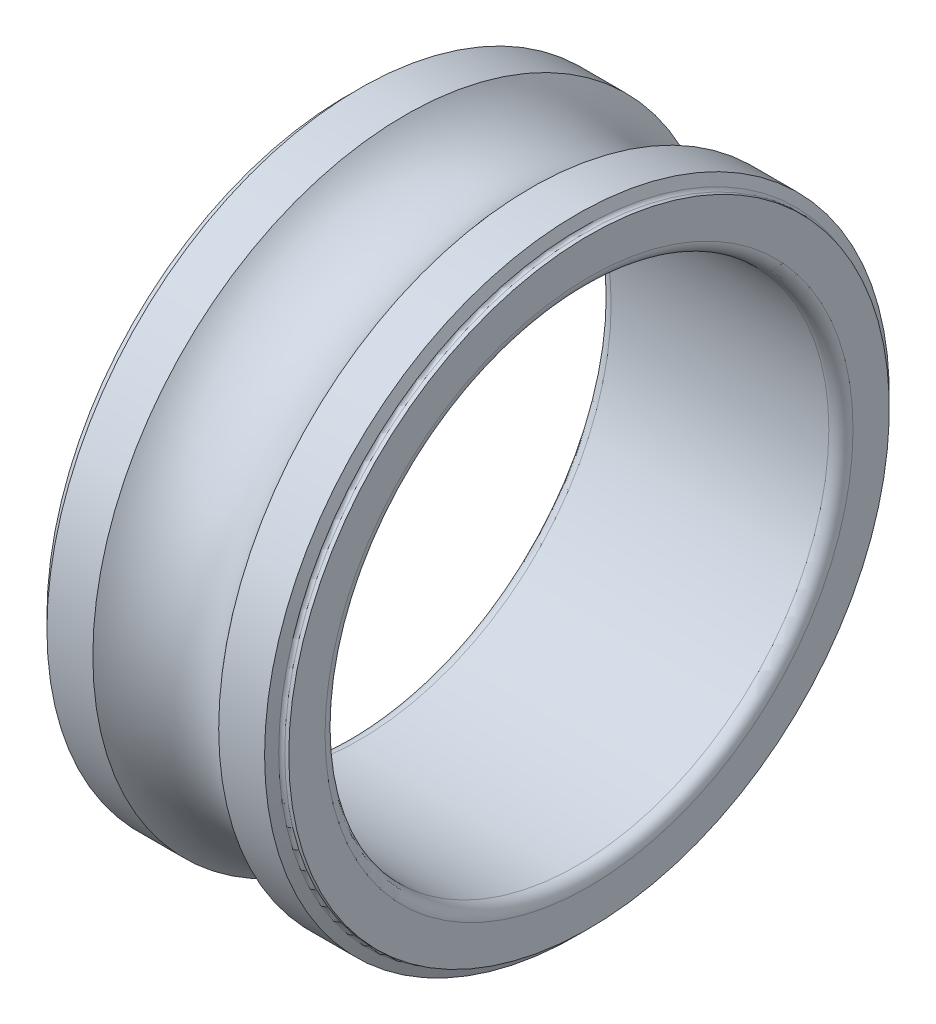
ISO-10303-21;
HEADER;
FILE_DESCRIPTION(('STEP AP214'),'2;1');
FILE_NAME('part.step','',(''),(''),'','','');
FILE_SCHEMA(('AUTOMOTIVE_DESIGN { 1 0 10303 214 1 1 1 1 }'));
ENDSEC;
DATA;
#1=APPLICATION_CONTEXT('core data for automotive mechanical design processes');
#2=APPLICATION_PROTOCOL_DEFINITION('international standard','automotive_design',2000,#1);
#3=PRODUCT_CONTEXT('',#1,'mechanical');
#4=PRODUCT('Part','Part','',(#3));
#5=PRODUCT_RELATED_PRODUCT_CATEGORY('part','',(#4));
#6=PRODUCT_DEFINITION_FORMATION('','',#4);
#7=PRODUCT_DEFINITION_CONTEXT('part definition',#1,'design');
#8=PRODUCT_DEFINITION('design','',#6,#7);
#9=PRODUCT_DEFINITION_SHAPE('','',#8);
#10=(LENGTH_UNIT() NAMED_UNIT(*) SI_UNIT(.MILLI.,.METRE.));
#11=(NAMED_UNIT(*) PLANE_ANGLE_UNIT() SI_UNIT($,.RADIAN.));
#12=(NAMED_UNIT(*) SI_UNIT($,.STERADIAN.) SOLID_ANGLE_UNIT());
#13=UNCERTAINTY_MEASURE_WITH_UNIT(LENGTH_MEASURE(1.E-05),#10,'distance_accuracy_value','');
#14=(GEOMETRIC_REPRESENTATION_CONTEXT(3) GLOBAL_UNCERTAINTY_ASSIGNED_CONTEXT((#13)) GLOBAL_UNIT_ASSIGNED_CONTEXT((#10,
#11,#12)) REPRESENTATION_CONTEXT('',''));
#15=CARTESIAN_POINT('',(0.,0.,0.));
#16=DIRECTION('',(0.,0.,1.));
#17=DIRECTION('',(1.,0.,0.));
#18=AXIS2_PLACEMENT_3D('',#15,#16,#17);
#19=CARTESIAN_POINT('',(11.8,0.,0.));
#20=DIRECTION('',(-1.,0.,0.));
#21=DIRECTION('',(0.,0.,1.));
#22=AXIS2_PLACEMENT_3D('',#19,#20,#21);
#23=TOROIDAL_SURFACE('',#22,15.1,0.200000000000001);
#24=CARTESIAN_POINT('',(11.6177124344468,0.,0.));
#25=DIRECTION('',(-1.,0.,0.));
#26=DIRECTION('',(0.,0.,1.));
#27=AXIS2_PLACEMENT_3D('',#24,#25,#26);
#28=CIRCLE('',#27,15.0177124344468);
#29=CARTESIAN_POINT('',(11.6177124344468,0.,15.0177124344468));
#30=VERTEX_POINT('',#29);
#31=EDGE_CURVE('E10',#30,#30,#28,.T.);
#32=ORIENTED_EDGE('',*,*,#31,.F.);
#33=EDGE_LOOP('',(#32));
#34=FACE_BOUND('',#33,.T.);
#35=CARTESIAN_POINT('',(11.8,0.,0.));
#36=DIRECTION('',(-1.,0.,0.));
#37=DIRECTION('',(0.,0.,1.));
#38=AXIS2_PLACEMENT_3D('',#35,#36,#37);
#39=CIRCLE('',#38,14.9);
#40=CARTESIAN_POINT('',(11.8,0.,14.9));
#41=VERTEX_POINT('',#40);
#42=EDGE_CURVE('E75',#41,#41,#39,.T.);
#43=ORIENTED_EDGE('',*,*,#42,.T.);
#44=EDGE_LOOP('',(#43));
#45=FACE_BOUND('',#44,.T.);
#46=ADVANCED_FACE('F29',(#34,#45),#23,.F.);
#47=CARTESIAN_POINT('',(11.6177124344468,0.,0.));
#48=DIRECTION('',(-1.,0.,0.));
#49=DIRECTION('',(0.,0.,1.));
#50=AXIS2_PLACEMENT_3D('',#47,#48,#49);
#51=CONICAL_SURFACE('',#50,15.0177124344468,1.14676528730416);
#52=CARTESIAN_POINT('',(11.4,0.,0.));
#53=DIRECTION('',(-1.,0.,0.));
#54=DIRECTION('',(0.,0.,1.));
#55=AXIS2_PLACEMENT_3D('',#52,#53,#54);
#56=CIRCLE('',#55,15.5);
#57=CARTESIAN_POINT('',(11.4,0.,15.5));
#58=VERTEX_POINT('',#57);
#59=EDGE_CURVE('E35',#58,#58,#56,.T.);
#60=ORIENTED_EDGE('',*,*,#59,.F.);
#61=EDGE_LOOP('',(#60));
#62=FACE_BOUND('',#61,.T.);
#63=ORIENTED_EDGE('',*,*,#31,.T.);
#64=EDGE_LOOP('',(#63));
#65=FACE_BOUND('',#64,.T.);
#66=ADVANCED_FACE('F148',(#62,#65),#51,.T.);
#67=CARTESIAN_POINT('',(-13.,0.,0.));
#68=DIRECTION('',(-1.,0.,0.));
#69=DIRECTION('',(0.,0.,1.));
#70=AXIS2_PLACEMENT_3D('',#67,#68,#69);
#71=CYLINDRICAL_SURFACE('',#70,15.5);
#72=CARTESIAN_POINT('',(9.12249899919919,0.,0.));
#73=DIRECTION('',(-1.,0.,0.));
#74=DIRECTION('',(0.,0.,1.));
#75=AXIS2_PLACEMENT_3D('',#72,#73,#74);
#76=CIRCLE('',#75,15.5);
#77=CARTESIAN_POINT('',(9.12249899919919,0.,15.5));
#78=VERTEX_POINT('',#77);
#79=EDGE_CURVE('E39',#78,#78,#76,.T.);
#80=ORIENTED_EDGE('',*,*,#79,.F.);
#81=EDGE_LOOP('',(#80));
#82=FACE_BOUND('',#81,.T.);
#83=ORIENTED_EDGE('',*,*,#59,.T.);
#84=EDGE_LOOP('',(#83));
#85=FACE_BOUND('',#84,.T.);
#86=ADVANCED_FACE('F143',(#82,#85),#71,.T.);
#87=CARTESIAN_POINT('',(6.,0.,0.));
#88=DIRECTION('',(-1.,0.,0.));
#89=DIRECTION('',(0.,0.,1.));
#90=AXIS2_PLACEMENT_3D('',#87,#88,#89);
#91=TOROIDAL_SURFACE('',#90,18.,4.);
#92=CARTESIAN_POINT('',(2.8775010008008,0.,0.));
#93=DIRECTION('',(-1.,0.,0.));
#94=DIRECTION('',(0.,0.,1.));
#95=AXIS2_PLACEMENT_3D('',#92,#93,#94);
#96=CIRCLE('',#95,15.5);
#97=CARTESIAN_POINT('',(2.8775010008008,0.,15.5));
#98=VERTEX_POINT('',#97);
#99=EDGE_CURVE('E43',#98,#98,#96,.T.);
#100=ORIENTED_EDGE('',*,*,#99,.F.);
#101=EDGE_LOOP('',(#100));
#102=FACE_BOUND('',#101,.T.);
#103=ORIENTED_EDGE('',*,*,#79,.T.);
#104=EDGE_LOOP('',(#103));
#105=FACE_BOUND('',#104,.T.);
#106=ADVANCED_FACE('F137',(#102,#105),#91,.F.);
#107=CARTESIAN_POINT('',(-13.,0.,0.));
#108=DIRECTION('',(-1.,0.,0.));
#109=DIRECTION('',(0.,0.,1.));
#110=AXIS2_PLACEMENT_3D('',#107,#108,#109);
#111=CYLINDRICAL_SURFACE('',#110,15.5);
#112=CARTESIAN_POINT('',(0.599999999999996,0.,0.));
#113=DIRECTION('',(-1.,0.,0.));
#114=DIRECTION('',(0.,0.,1.));
#115=AXIS2_PLACEMENT_3D('',#112,#113,#114);
#116=CIRCLE('',#115,15.5);
#117=CARTESIAN_POINT('',(0.599999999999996,0.,15.5));
#118=VERTEX_POINT('',#117);
#119=EDGE_CURVE('E48',#118,#118,#116,.T.);
#120=ORIENTED_EDGE('',*,*,#119,.F.);
#121=EDGE_LOOP('',(#120));
#122=FACE_BOUND('',#121,.T.);
#123=ORIENTED_EDGE('',*,*,#99,.T.);
#124=EDGE_LOOP('',(#123));
#125=FACE_BOUND('',#124,.T.);
#126=ADVANCED_FACE('F131',(#122,#125),#111,.T.);
#127=CARTESIAN_POINT('',(0.599999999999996,0.,0.));
#128=DIRECTION('',(1.,0.,0.));
#129=DIRECTION('',(0.,0.,-1.));
#130=AXIS2_PLACEMENT_3D('',#127,#128,#129);
#131=CONICAL_SURFACE('',#130,15.5,1.14676528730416);
#132=CARTESIAN_POINT('',(0.382287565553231,0.,0.));
#133=DIRECTION('',(-1.,0.,0.));
#134=DIRECTION('',(0.,0.,1.));
#135=AXIS2_PLACEMENT_3D('',#132,#133,#134);
#136=CIRCLE('',#135,15.0177124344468);
#137=CARTESIAN_POINT('',(0.382287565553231,0.,15.0177124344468));
#138=VERTEX_POINT('',#137);
#139=EDGE_CURVE('E51',#138,#138,#136,.T.);
#140=ORIENTED_EDGE('',*,*,#139,.F.);
#141=EDGE_LOOP('',(#140));
#142=FACE_BOUND('',#141,.T.);
#143=ORIENTED_EDGE('',*,*,#119,.T.);
#144=EDGE_LOOP('',(#143));
#145=FACE_BOUND('',#144,.T.);
#146=ADVANCED_FACE('F125',(#142,#145),#131,.T.);
#147=CARTESIAN_POINT('',(0.199999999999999,0.,0.));
#148=DIRECTION('',(-1.,0.,0.));
#149=DIRECTION('',(0.,0.,1.));
#150=AXIS2_PLACEMENT_3D('',#147,#148,#149);
#151=TOROIDAL_SURFACE('',#150,15.1,0.2);
#152=CARTESIAN_POINT('',(0.199999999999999,0.,0.));
#153=DIRECTION('',(-1.,0.,0.));
#154=DIRECTION('',(0.,0.,1.));
#155=AXIS2_PLACEMENT_3D('',#152,#153,#154);
#156=CIRCLE('',#155,14.9);
#157=CARTESIAN_POINT('',(0.199999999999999,0.,14.9));
#158=VERTEX_POINT('',#157);
#159=EDGE_CURVE('E54',#158,#158,#156,.T.);
#160=ORIENTED_EDGE('',*,*,#159,.F.);
#161=EDGE_LOOP('',(#160));
#162=FACE_BOUND('',#161,.T.);
#163=ORIENTED_EDGE('',*,*,#139,.T.);
#164=EDGE_LOOP('',(#163));
#165=FACE_BOUND('',#164,.T.);
#166=ADVANCED_FACE('F119',(#162,#165),#151,.F.);
#167=CARTESIAN_POINT('',(-13.,0.,0.));
#168=DIRECTION('',(-1.,0.,0.));
#169=DIRECTION('',(0.,0.,1.));
#170=AXIS2_PLACEMENT_3D('',#167,#168,#169);
#171=CYLINDRICAL_SURFACE('',#170,14.9);
#172=CARTESIAN_POINT('',(0.,0.,0.));
#173=DIRECTION('',(-1.,0.,0.));
#174=DIRECTION('',(0.,0.,1.));
#175=AXIS2_PLACEMENT_3D('',#172,#173,#174);
#176=CIRCLE('',#175,14.9);
#177=CARTESIAN_POINT('',(0.,0.,14.9));
#178=VERTEX_POINT('',#177);
#179=EDGE_CURVE('E57',#178,#178,#176,.T.);
#180=ORIENTED_EDGE('',*,*,#179,.F.);
#181=EDGE_LOOP('',(#180));
#182=FACE_BOUND('',#181,.T.);
#183=ORIENTED_EDGE('',*,*,#159,.T.);
#184=EDGE_LOOP('',(#183));
#185=FACE_BOUND('',#184,.T.);
#186=ADVANCED_FACE('F113',(#182,#185),#171,.T.);
#187=CARTESIAN_POINT('',(0.,13.1,0.));
#188=DIRECTION('',(1.,0.,0.));
#189=DIRECTION('',(0.,0.,-1.));
#190=AXIS2_PLACEMENT_3D('',#187,#188,#189);
#191=PLANE('',#190);
#192=CARTESIAN_POINT('',(0.,0.,0.));
#193=DIRECTION('',(-1.,0.,0.));
#194=DIRECTION('',(0.,0.,1.));
#195=AXIS2_PLACEMENT_3D('',#192,#193,#194);
#196=CIRCLE('',#195,13.1);
#197=CARTESIAN_POINT('',(0.,0.,13.1));
#198=VERTEX_POINT('',#197);
#199=EDGE_CURVE('E60',#198,#198,#196,.T.);
#200=ORIENTED_EDGE('',*,*,#199,.F.);
#201=EDGE_LOOP('',(#200));
#202=FACE_BOUND('',#201,.T.);
#203=ORIENTED_EDGE('',*,*,#179,.T.);
#204=EDGE_LOOP('',(#203));
#205=FACE_BOUND('',#204,.T.);
#206=ADVANCED_FACE('F107',(#202,#205),#191,.F.);
#207=CARTESIAN_POINT('',(0.599999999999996,0.,0.));
#208=DIRECTION('',(-1.,0.,0.));
#209=DIRECTION('',(0.,0.,1.));
#210=AXIS2_PLACEMENT_3D('',#207,#208,#209);
#211=TOROIDAL_SURFACE('',#210,13.1,0.6);
#212=CARTESIAN_POINT('',(0.599999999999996,0.,0.));
#213=DIRECTION('',(-1.,0.,0.));
#214=DIRECTION('',(0.,0.,1.));
#215=AXIS2_PLACEMENT_3D('',#212,#213,#214);
#216=CIRCLE('',#215,12.5);
#217=CARTESIAN_POINT('',(0.599999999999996,0.,12.5));
#218=VERTEX_POINT('',#217);
#219=EDGE_CURVE('E63',#218,#218,#216,.T.);
#220=ORIENTED_EDGE('',*,*,#219,.F.);
#221=EDGE_LOOP('',(#220));
#222=FACE_BOUND('',#221,.T.);
#223=ORIENTED_EDGE('',*,*,#199,.T.);
#224=EDGE_LOOP('',(#223));
#225=FACE_BOUND('',#224,.T.);
#226=ADVANCED_FACE('F101',(#222,#225),#211,.T.);
#227=CARTESIAN_POINT('',(-13.,0.,0.));
#228=DIRECTION('',(-1.,0.,0.));
#229=DIRECTION('',(0.,0.,1.));
#230=AXIS2_PLACEMENT_3D('',#227,#228,#229);
#231=CYLINDRICAL_SURFACE('',#230,12.5);
#232=CARTESIAN_POINT('',(11.4,0.,0.));
#233=DIRECTION('',(-1.,0.,0.));
#234=DIRECTION('',(0.,0.,1.));
#235=AXIS2_PLACEMENT_3D('',#232,#233,#234);
#236=CIRCLE('',#235,12.5);
#237=CARTESIAN_POINT('',(11.4,0.,12.5));
#238=VERTEX_POINT('',#237);
#239=EDGE_CURVE('E66',#238,#238,#236,.T.);
#240=ORIENTED_EDGE('',*,*,#239,.F.);
#241=EDGE_LOOP('',(#240));
#242=FACE_BOUND('',#241,.T.);
#243=ORIENTED_EDGE('',*,*,#219,.T.);
#244=EDGE_LOOP('',(#243));
#245=FACE_BOUND('',#244,.T.);
#246=ADVANCED_FACE('F95',(#242,#245),#231,.F.);
#247=CARTESIAN_POINT('',(11.4,0.,0.));
#248=DIRECTION('',(-1.,0.,0.));
#249=DIRECTION('',(0.,0.,1.));
#250=AXIS2_PLACEMENT_3D('',#247,#248,#249);
#251=TOROIDAL_SURFACE('',#250,13.1,0.599999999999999);
#252=CARTESIAN_POINT('',(12.,0.,0.));
#253=DIRECTION('',(-1.,0.,0.));
#254=DIRECTION('',(0.,0.,1.));
#255=AXIS2_PLACEMENT_3D('',#252,#253,#254);
#256=CIRCLE('',#255,13.1);
#257=CARTESIAN_POINT('',(12.,0.,13.1));
#258=VERTEX_POINT('',#257);
#259=EDGE_CURVE('E69',#258,#258,#256,.T.);
#260=ORIENTED_EDGE('',*,*,#259,.F.);
#261=EDGE_LOOP('',(#260));
#262=FACE_BOUND('',#261,.T.);
#263=ORIENTED_EDGE('',*,*,#239,.T.);
#264=EDGE_LOOP('',(#263));
#265=FACE_BOUND('',#264,.T.);
#266=ADVANCED_FACE('F89',(#262,#265),#251,.T.);
#267=CARTESIAN_POINT('',(12.,13.1,0.));
#268=DIRECTION('',(-1.,0.,0.));
#269=DIRECTION('',(0.,0.,1.));
#270=AXIS2_PLACEMENT_3D('',#267,#268,#269);
#271=PLANE('',#270);
#272=CARTESIAN_POINT('',(12.,0.,0.));
#273=DIRECTION('',(-1.,0.,0.));
#274=DIRECTION('',(0.,0.,1.));
#275=AXIS2_PLACEMENT_3D('',#272,#273,#274);
#276=CIRCLE('',#275,14.9);
#277=CARTESIAN_POINT('',(12.,0.,14.9));
#278=VERTEX_POINT('',#277);
#279=EDGE_CURVE('E72',#278,#278,#276,.T.);
#280=ORIENTED_EDGE('',*,*,#279,.F.);
#281=EDGE_LOOP('',(#280));
#282=FACE_BOUND('',#281,.T.);
#283=ORIENTED_EDGE('',*,*,#259,.T.);
#284=EDGE_LOOP('',(#283));
#285=FACE_BOUND('',#284,.T.);
#286=ADVANCED_FACE('F83',(#282,#285),#271,.F.);
#287=CARTESIAN_POINT('',(-13.,0.,0.));
#288=DIRECTION('',(-1.,0.,0.));
#289=DIRECTION('',(0.,0.,1.));
#290=AXIS2_PLACEMENT_3D('',#287,#288,#289);
#291=CYLINDRICAL_SURFACE('',#290,14.9);
#292=ORIENTED_EDGE('',*,*,#42,.F.);
#293=EDGE_LOOP('',(#292));
#294=FACE_BOUND('',#293,.T.);
#295=ORIENTED_EDGE('',*,*,#279,.T.);
#296=EDGE_LOOP('',(#295));
#297=FACE_BOUND('',#296,.T.);
#298=ADVANCED_FACE('F80',(#294,#297),#291,.T.);
#299=CLOSED_SHELL('',(#46,#66,#86,#106,#126,#146,#166,#186,#206,#226,#246,#266,#286,#298));
#300=MANIFOLD_SOLID_BREP('B2',#299);
#301=ADVANCED_BREP_SHAPE_REPRESENTATION('',(#18,#300),#14);
#302=SHAPE_DEFINITION_REPRESENTATION(#9,#301);
ENDSEC;
END-ISO-10303-21;
